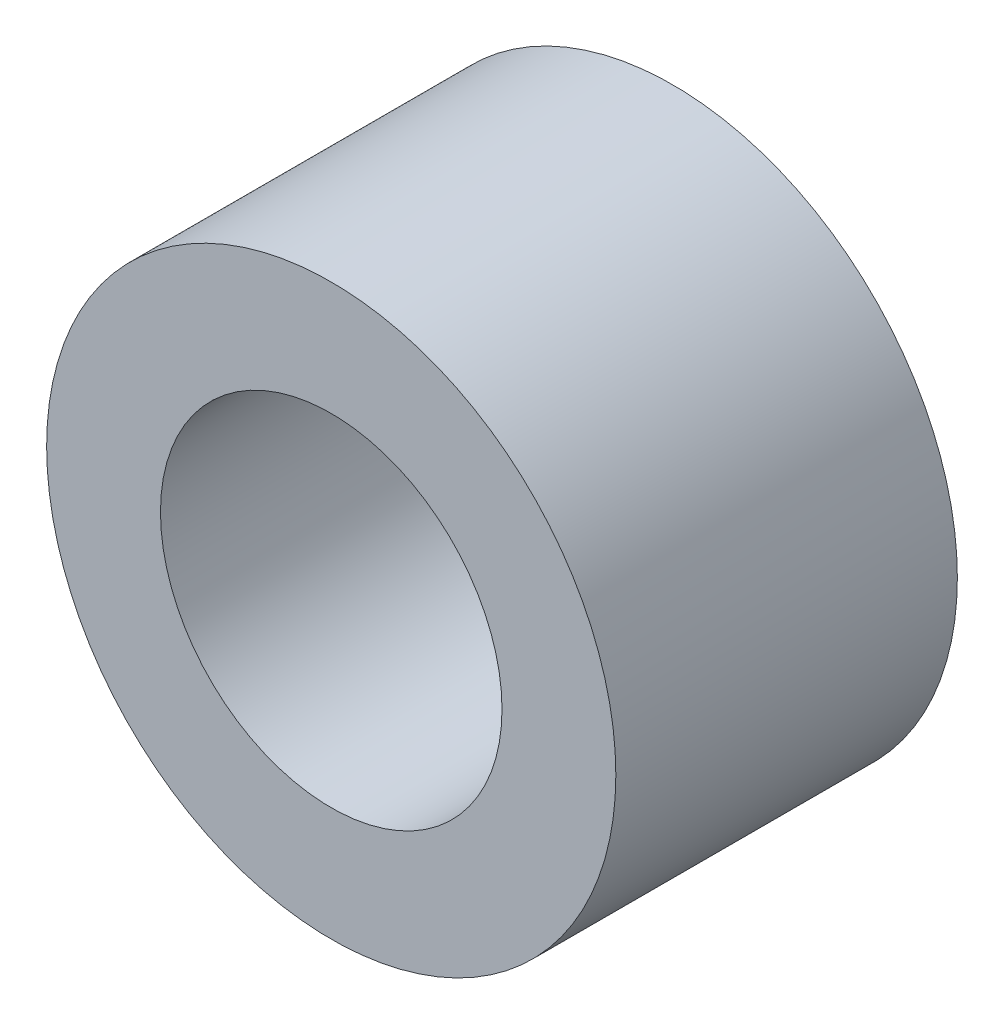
ISO-10303-21;
HEADER;
FILE_DESCRIPTION(('STEP AP214'),'2;1');
FILE_NAME('part.step','',(''),(''),'','','');
FILE_SCHEMA(('AUTOMOTIVE_DESIGN { 1 0 10303 214 1 1 1 1 }'));
ENDSEC;
DATA;
#1=APPLICATION_CONTEXT('core data for automotive mechanical design processes');
#2=APPLICATION_PROTOCOL_DEFINITION('international standard','automotive_design',2000,#1);
#3=PRODUCT_CONTEXT('',#1,'mechanical');
#4=PRODUCT('Part','Part','',(#3));
#5=PRODUCT_RELATED_PRODUCT_CATEGORY('part','',(#4));
#6=PRODUCT_DEFINITION_FORMATION('','',#4);
#7=PRODUCT_DEFINITION_CONTEXT('part definition',#1,'design');
#8=PRODUCT_DEFINITION('design','',#6,#7);
#9=PRODUCT_DEFINITION_SHAPE('','',#8);
#10=(LENGTH_UNIT() NAMED_UNIT(*) SI_UNIT(.MILLI.,.METRE.));
#11=(NAMED_UNIT(*) PLANE_ANGLE_UNIT() SI_UNIT($,.RADIAN.));
#12=(NAMED_UNIT(*) SI_UNIT($,.STERADIAN.) SOLID_ANGLE_UNIT());
#13=UNCERTAINTY_MEASURE_WITH_UNIT(LENGTH_MEASURE(1.E-05),#10,'distance_accuracy_value','');
#14=(GEOMETRIC_REPRESENTATION_CONTEXT(3) GLOBAL_UNCERTAINTY_ASSIGNED_CONTEXT((#13)) GLOBAL_UNIT_ASSIGNED_CONTEXT((#10,
#11,#12)) REPRESENTATION_CONTEXT('',''));
#15=CARTESIAN_POINT('',(0.,0.,0.));
#16=DIRECTION('',(0.,0.,1.));
#17=DIRECTION('',(1.,0.,0.));
#18=AXIS2_PLACEMENT_3D('',#15,#16,#17);
#19=CARTESIAN_POINT('',(-1.54390389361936E-13,15.,1.5));
#20=DIRECTION('',(0.,0.,1.));
#21=DIRECTION('',(1.,0.,0.));
#22=AXIS2_PLACEMENT_3D('',#19,#20,#21);
#23=PLANE('',#22);
#24=CARTESIAN_POINT('',(-1.54390389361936E-13,15.,1.5));
#25=DIRECTION('',(0.,0.,1.));
#26=DIRECTION('',(1.,0.,0.));
#27=AXIS2_PLACEMENT_3D('',#24,#25,#26);
#28=CIRCLE('',#27,2.5);
#29=CARTESIAN_POINT('',(2.49999999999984,15.,1.5));
#30=VERTEX_POINT('',#29);
#31=EDGE_CURVE('E10',#30,#30,#28,.T.);
#32=ORIENTED_EDGE('',*,*,#31,.T.);
#33=EDGE_LOOP('',(#32));
#34=FACE_BOUND('',#33,.T.);
#35=CARTESIAN_POINT('',(-1.54390389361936E-13,15.,1.5));
#36=DIRECTION('',(0.,0.,1.));
#37=DIRECTION('',(1.,0.,0.));
#38=AXIS2_PLACEMENT_3D('',#35,#36,#37);
#39=CIRCLE('',#38,1.5);
#40=CARTESIAN_POINT('',(1.49999999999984,15.,1.5));
#41=VERTEX_POINT('',#40);
#42=EDGE_CURVE('E35',#41,#41,#39,.T.);
#43=ORIENTED_EDGE('',*,*,#42,.F.);
#44=EDGE_LOOP('',(#43));
#45=FACE_BOUND('',#44,.T.);
#46=ADVANCED_FACE('F28',(#34,#45),#23,.T.);
#47=CARTESIAN_POINT('',(-1.54390389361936E-13,15.,1.5));
#48=DIRECTION('',(0.,0.,-1.));
#49=DIRECTION('',(-1.,0.,0.));
#50=AXIS2_PLACEMENT_3D('',#47,#48,#49);
#51=CYLINDRICAL_SURFACE('',#50,2.5);
#52=ORIENTED_EDGE('',*,*,#31,.F.);
#53=EDGE_LOOP('',(#52));
#54=FACE_BOUND('',#53,.T.);
#55=CARTESIAN_POINT('',(-1.54390389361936E-13,15.,-1.5));
#56=DIRECTION('',(0.,0.,1.));
#57=DIRECTION('',(1.,0.,0.));
#58=AXIS2_PLACEMENT_3D('',#55,#56,#57);
#59=CIRCLE('',#58,2.5);
#60=CARTESIAN_POINT('',(2.49999999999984,15.,-1.5));
#61=VERTEX_POINT('',#60);
#62=EDGE_CURVE('E39',#61,#61,#59,.T.);
#63=ORIENTED_EDGE('',*,*,#62,.T.);
#64=EDGE_LOOP('',(#63));
#65=FACE_BOUND('',#64,.T.);
#66=ADVANCED_FACE('F30',(#54,#65),#51,.T.);
#67=CARTESIAN_POINT('',(-1.54390389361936E-13,15.,1.5));
#68=DIRECTION('',(0.,0.,-1.));
#69=DIRECTION('',(-1.,0.,0.));
#70=AXIS2_PLACEMENT_3D('',#67,#68,#69);
#71=CYLINDRICAL_SURFACE('',#70,1.5);
#72=ORIENTED_EDGE('',*,*,#42,.T.);
#73=EDGE_LOOP('',(#72));
#74=FACE_BOUND('',#73,.T.);
#75=CARTESIAN_POINT('',(-1.54390389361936E-13,15.,-1.5));
#76=DIRECTION('',(0.,0.,1.));
#77=DIRECTION('',(1.,0.,0.));
#78=AXIS2_PLACEMENT_3D('',#75,#76,#77);
#79=CIRCLE('',#78,1.5);
#80=CARTESIAN_POINT('',(1.49999999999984,15.,-1.5));
#81=VERTEX_POINT('',#80);
#82=EDGE_CURVE('E43',#81,#81,#79,.T.);
#83=ORIENTED_EDGE('',*,*,#82,.F.);
#84=EDGE_LOOP('',(#83));
#85=FACE_BOUND('',#84,.T.);
#86=ADVANCED_FACE('F52',(#74,#85),#71,.F.);
#87=CARTESIAN_POINT('',(-1.54390389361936E-13,15.,-1.5));
#88=DIRECTION('',(0.,0.,1.));
#89=DIRECTION('',(1.,0.,0.));
#90=AXIS2_PLACEMENT_3D('',#87,#88,#89);
#91=PLANE('',#90);
#92=ORIENTED_EDGE('',*,*,#82,.T.);
#93=EDGE_LOOP('',(#92));
#94=FACE_BOUND('',#93,.T.);
#95=ORIENTED_EDGE('',*,*,#62,.F.);
#96=EDGE_LOOP('',(#95));
#97=FACE_BOUND('',#96,.T.);
#98=ADVANCED_FACE('F49',(#94,#97),#91,.F.);
#99=CLOSED_SHELL('',(#46,#66,#86,#98));
#100=MANIFOLD_SOLID_BREP('B2',#99);
#101=ADVANCED_BREP_SHAPE_REPRESENTATION('',(#18,#100),#14);
#102=SHAPE_DEFINITION_REPRESENTATION(#9,#101);
ENDSEC;
END-ISO-10303-21;
